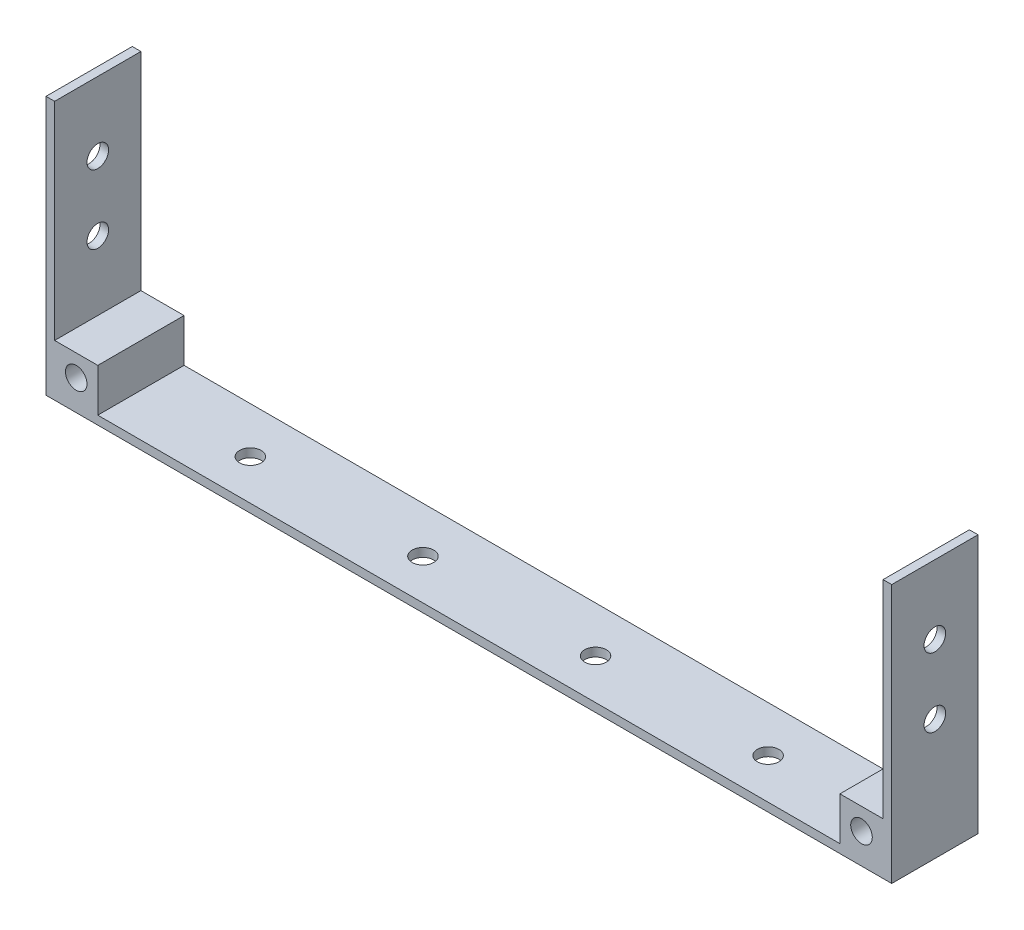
from build123d import *

# Parameters (mm, degrees)
SKETCH1_W           = 12.7
SKETCH1_H           = 12.7
SKETCH1_R           = 3.175
BOSS_EXTRUDE1_DEPTH = 25.4
SKETCH2_R           = 3.175
CUT_EXTRUDE1_DEPTH  = 261.82968006
SKETCH3_R           = 3.175
CUT_EXTRUDE2_DEPTH  = 262.558342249


with BuildPart() as part:
    # Sketch1 → Boss-Extrude1 (new body)
    # profile 1 of 3: a face of its own
    with BuildSketch(Plane.XY):
        with Locations((8.89, 8.89)):
            Rectangle(SKETCH1_W, SKETCH1_H)
        with Locations((8.89, 8.89)):
            Circle(SKETCH1_R, mode=Mode.SUBTRACT)
    # profile 2 of 3: a face of its own
    with BuildSketch(Plane.XY):
        Polygon((246.38, 76.2), (248.92, 76.2), (248.92, 0), (0, 0), (0, 76.2), (2.54, 76.2), (2.54, 2.54), (246.38, 2.54), align=None)
    # profile 3 of 3: a face of its own
    with BuildSketch(Plane.XY):
        with Locations((240.03, 8.89)):
            Rectangle(SKETCH1_W, SKETCH1_H)
        with Locations((240.03, 8.89)):
            Circle(SKETCH1_R, mode=Mode.SUBTRACT)
    extrude(amount=BOSS_EXTRUDE1_DEPTH)

    # Sketch2 → Cut-Extrude1 (cut, through all)
    with BuildSketch(Plane(origin=(0, 2.54, 0), x_dir=(1, 0, 0), z_dir=(0, 1, 0))):
        with Locations(Location((48.26, -13.512234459, 0), (0, 0, 270))):
            Circle(SKETCH2_R)
        with Locations(Location((99.06, -13.512234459, 0), (0, 0, 270))):
            Circle(SKETCH2_R)
        with Locations(Location((149.86, -13.512234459, 0), (0, 0, 270))):
            Circle(SKETCH2_R)
        with Locations(Location((200.66, -13.512234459, 0), (0, 0, 270))):
            Circle(SKETCH2_R)
    extrude(amount=-CUT_EXTRUDE1_DEPTH, mode=Mode.SUBTRACT)

    # Sketch3 → Cut-Extrude2 (cut, through all)
    with BuildSketch(Plane(origin=(248.92, 0, 0), x_dir=(0, 0, -1), z_dir=(1, 0, 0))):
        with Locations((-12.7, 55.88)):
            Circle(SKETCH3_R)
        with Locations((-12.7, 35.56)):
            Circle(SKETCH3_R)
    extrude(amount=-CUT_EXTRUDE2_DEPTH, mode=Mode.SUBTRACT)


solid = part.part
